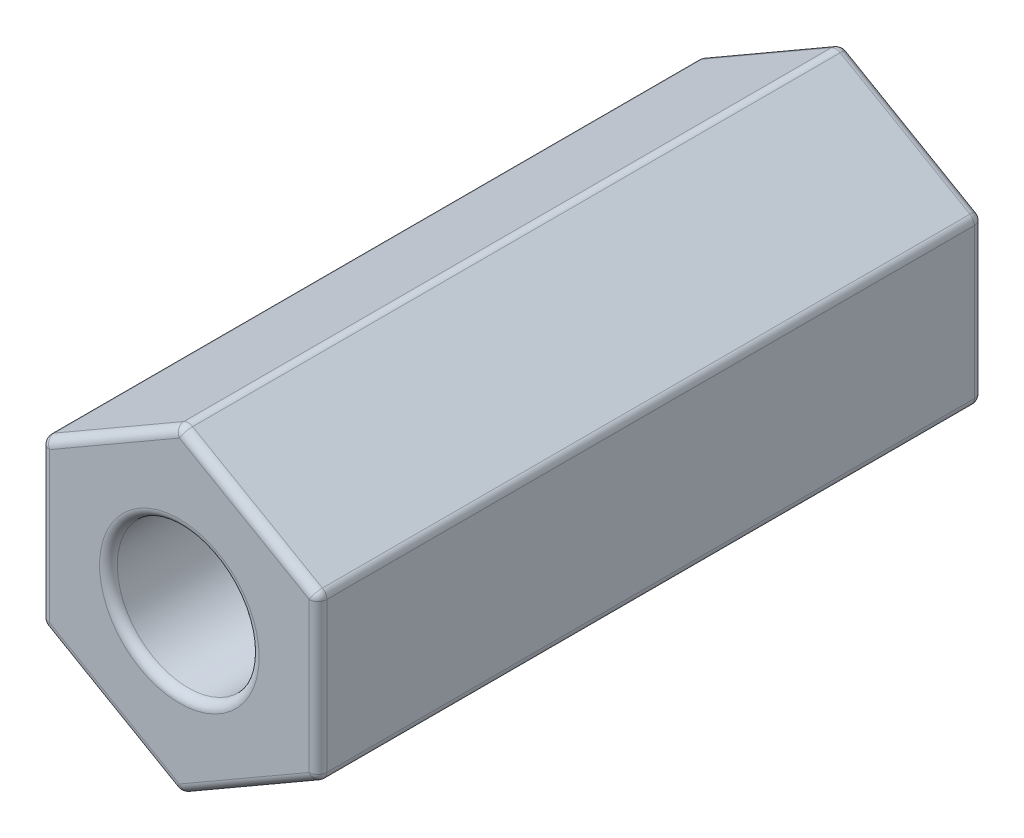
ISO-10303-21;
HEADER;
FILE_DESCRIPTION(('STEP AP214'),'2;1');
FILE_NAME('part.step','',(''),(''),'','','');
FILE_SCHEMA(('AUTOMOTIVE_DESIGN { 1 0 10303 214 1 1 1 1 }'));
ENDSEC;
DATA;
#1=APPLICATION_CONTEXT('core data for automotive mechanical design processes');
#2=APPLICATION_PROTOCOL_DEFINITION('international standard','automotive_design',2000,#1);
#3=PRODUCT_CONTEXT('',#1,'mechanical');
#4=PRODUCT('Part','Part','',(#3));
#5=PRODUCT_RELATED_PRODUCT_CATEGORY('part','',(#4));
#6=PRODUCT_DEFINITION_FORMATION('','',#4);
#7=PRODUCT_DEFINITION_CONTEXT('part definition',#1,'design');
#8=PRODUCT_DEFINITION('design','',#6,#7);
#9=PRODUCT_DEFINITION_SHAPE('','',#8);
#10=(LENGTH_UNIT() NAMED_UNIT(*) SI_UNIT(.MILLI.,.METRE.));
#11=(NAMED_UNIT(*) PLANE_ANGLE_UNIT() SI_UNIT($,.RADIAN.));
#12=(NAMED_UNIT(*) SI_UNIT($,.STERADIAN.) SOLID_ANGLE_UNIT());
#13=UNCERTAINTY_MEASURE_WITH_UNIT(LENGTH_MEASURE(1.E-05),#10,'distance_accuracy_value','');
#14=(GEOMETRIC_REPRESENTATION_CONTEXT(3) GLOBAL_UNCERTAINTY_ASSIGNED_CONTEXT((#13)) GLOBAL_UNIT_ASSIGNED_CONTEXT((#10,
#11,#12)) REPRESENTATION_CONTEXT('',''));
#15=CARTESIAN_POINT('',(0.,0.,0.));
#16=DIRECTION('',(0.,0.,1.));
#17=DIRECTION('',(1.,0.,0.));
#18=AXIS2_PLACEMENT_3D('',#15,#16,#17);
#19=CARTESIAN_POINT('',(3.96874999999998,2.29135888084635,-19.05));
#20=DIRECTION('',(0.499999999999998,0.86602540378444,0.));
#21=DIRECTION('',(-0.86602540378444,0.499999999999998,0.));
#22=AXIS2_PLACEMENT_3D('',#19,#20,#21);
#23=PLANE('',#22);
#24=DIRECTION('',(-0.86602540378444,0.499999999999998,0.));
#25=VECTOR('',#24,1.);
#26=CARTESIAN_POINT('',(3.96874999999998,2.29135888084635,-0.254000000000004));
#27=LINE('',#26,#25);
#28=CARTESIAN_POINT('',(0.127000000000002,4.50939427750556,-0.254000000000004));
#29=VERTEX_POINT('',#28);
#30=CARTESIAN_POINT('',(3.84174999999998,2.36468236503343,-0.254000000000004));
#31=VERTEX_POINT('',#30);
#32=EDGE_CURVE('E187',#29,#31,#27,.F.);
#33=ORIENTED_EDGE('',*,*,#32,.T.);
#34=DIRECTION('',(0.,0.,1.));
#35=VECTOR('',#34,1.);
#36=CARTESIAN_POINT('',(3.84174999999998,2.36468236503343,-19.05));
#37=LINE('',#36,#35);
#38=CARTESIAN_POINT('',(3.84174999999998,2.36468236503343,-18.796));
#39=VERTEX_POINT('',#38);
#40=EDGE_CURVE('E191',#31,#39,#37,.F.);
#41=ORIENTED_EDGE('',*,*,#40,.T.);
#42=DIRECTION('',(-0.86602540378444,0.499999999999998,0.));
#43=VECTOR('',#42,1.);
#44=CARTESIAN_POINT('',(0.,4.58271776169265,-18.796));
#45=LINE('',#44,#43);
#46=CARTESIAN_POINT('',(0.127000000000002,4.50939427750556,-18.796));
#47=VERTEX_POINT('',#46);
#48=EDGE_CURVE('E163',#39,#47,#45,.T.);
#49=ORIENTED_EDGE('',*,*,#48,.T.);
#50=DIRECTION('',(0.,0.,1.));
#51=VECTOR('',#50,1.);
#52=CARTESIAN_POINT('',(0.127000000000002,4.50939427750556,-19.05));
#53=LINE('',#52,#51);
#54=EDGE_CURVE('E181',#47,#29,#53,.T.);
#55=ORIENTED_EDGE('',*,*,#54,.T.);
#56=EDGE_LOOP('',(#33,#41,#49,#55));
#57=FACE_BOUND('',#56,.T.);
#58=ADVANCED_FACE('F36',(#57),#23,.T.);
#59=CARTESIAN_POINT('',(3.96875000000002,-2.29135888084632,-19.05));
#60=DIRECTION('',(1.,0.,0.));
#61=DIRECTION('',(0.,1.,0.));
#62=AXIS2_PLACEMENT_3D('',#59,#60,#61);
#63=PLANE('',#62);
#64=DIRECTION('',(0.,1.,0.));
#65=VECTOR('',#64,1.);
#66=CARTESIAN_POINT('',(3.96875000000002,-2.29135888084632,-0.254000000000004));
#67=LINE('',#66,#65);
#68=CARTESIAN_POINT('',(3.96874999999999,2.14471191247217,-0.254000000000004));
#69=VERTEX_POINT('',#68);
#70=CARTESIAN_POINT('',(3.96875000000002,-2.14471191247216,-0.254000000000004));
#71=VERTEX_POINT('',#70);
#72=EDGE_CURVE('E250',#69,#71,#67,.F.);
#73=ORIENTED_EDGE('',*,*,#72,.T.);
#74=DIRECTION('',(0.,0.,1.));
#75=VECTOR('',#74,1.);
#76=CARTESIAN_POINT('',(3.96875000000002,-2.14471191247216,-19.05));
#77=LINE('',#76,#75);
#78=CARTESIAN_POINT('',(3.96875000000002,-2.14471191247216,-18.796));
#79=VERTEX_POINT('',#78);
#80=EDGE_CURVE('E255',#71,#79,#77,.F.);
#81=ORIENTED_EDGE('',*,*,#80,.T.);
#82=DIRECTION('',(0.,1.,0.));
#83=VECTOR('',#82,1.);
#84=CARTESIAN_POINT('',(3.96874999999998,2.29135888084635,-18.796));
#85=LINE('',#84,#83);
#86=CARTESIAN_POINT('',(3.96874999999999,2.14471191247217,-18.796));
#87=VERTEX_POINT('',#86);
#88=EDGE_CURVE('E252',#79,#87,#85,.T.);
#89=ORIENTED_EDGE('',*,*,#88,.T.);
#90=DIRECTION('',(0.,0.,1.));
#91=VECTOR('',#90,1.);
#92=CARTESIAN_POINT('',(3.96874999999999,2.14471191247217,-19.05));
#93=LINE('',#92,#91);
#94=EDGE_CURVE('E248',#87,#69,#93,.T.);
#95=ORIENTED_EDGE('',*,*,#94,.T.);
#96=EDGE_LOOP('',(#73,#81,#89,#95));
#97=FACE_BOUND('',#96,.T.);
#98=ADVANCED_FACE('F420',(#97),#63,.T.);
#99=CARTESIAN_POINT('',(0.,-4.58271776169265,-19.05));
#100=DIRECTION('',(0.499999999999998,-0.86602540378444,0.));
#101=DIRECTION('',(0.86602540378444,0.499999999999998,0.));
#102=AXIS2_PLACEMENT_3D('',#99,#100,#101);
#103=PLANE('',#102);
#104=DIRECTION('',(0.86602540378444,0.499999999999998,0.));
#105=VECTOR('',#104,1.);
#106=CARTESIAN_POINT('',(0.,-4.58271776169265,-0.254000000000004));
#107=LINE('',#106,#105);
#108=CARTESIAN_POINT('',(3.84175000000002,-2.36468236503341,-0.254000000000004));
#109=VERTEX_POINT('',#108);
#110=CARTESIAN_POINT('',(0.127000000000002,-4.50939427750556,-0.254000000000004));
#111=VERTEX_POINT('',#110);
#112=EDGE_CURVE('E241',#109,#111,#107,.F.);
#113=ORIENTED_EDGE('',*,*,#112,.T.);
#114=DIRECTION('',(0.,0.,1.));
#115=VECTOR('',#114,1.);
#116=CARTESIAN_POINT('',(0.127000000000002,-4.50939427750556,-19.05));
#117=LINE('',#116,#115);
#118=CARTESIAN_POINT('',(0.127000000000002,-4.50939427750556,-18.796));
#119=VERTEX_POINT('',#118);
#120=EDGE_CURVE('E246',#111,#119,#117,.F.);
#121=ORIENTED_EDGE('',*,*,#120,.T.);
#122=DIRECTION('',(0.86602540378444,0.499999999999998,0.));
#123=VECTOR('',#122,1.);
#124=CARTESIAN_POINT('',(3.96875000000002,-2.29135888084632,-18.796));
#125=LINE('',#124,#123);
#126=CARTESIAN_POINT('',(3.84175000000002,-2.36468236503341,-18.796));
#127=VERTEX_POINT('',#126);
#128=EDGE_CURVE('E243',#119,#127,#125,.T.);
#129=ORIENTED_EDGE('',*,*,#128,.T.);
#130=DIRECTION('',(0.,0.,1.));
#131=VECTOR('',#130,1.);
#132=CARTESIAN_POINT('',(3.84175000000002,-2.36468236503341,-19.05));
#133=LINE('',#132,#131);
#134=EDGE_CURVE('E239',#127,#109,#133,.T.);
#135=ORIENTED_EDGE('',*,*,#134,.T.);
#136=EDGE_LOOP('',(#113,#121,#129,#135));
#137=FACE_BOUND('',#136,.T.);
#138=ADVANCED_FACE('F324',(#137),#103,.T.);
#139=CARTESIAN_POINT('',(-3.96874999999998,-2.29135888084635,-19.05));
#140=DIRECTION('',(-0.499999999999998,-0.86602540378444,0.));
#141=DIRECTION('',(0.86602540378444,-0.499999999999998,0.));
#142=AXIS2_PLACEMENT_3D('',#139,#140,#141);
#143=PLANE('',#142);
#144=DIRECTION('',(0.86602540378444,-0.499999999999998,0.));
#145=VECTOR('',#144,1.);
#146=CARTESIAN_POINT('',(-3.96874999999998,-2.29135888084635,-0.254000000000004));
#147=LINE('',#146,#145);
#148=CARTESIAN_POINT('',(-0.127000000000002,-4.50939427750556,-0.254000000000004));
#149=VERTEX_POINT('',#148);
#150=CARTESIAN_POINT('',(-3.84174999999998,-2.36468236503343,-0.254000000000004));
#151=VERTEX_POINT('',#150);
#152=EDGE_CURVE('E232',#149,#151,#147,.F.);
#153=ORIENTED_EDGE('',*,*,#152,.T.);
#154=DIRECTION('',(0.,0.,1.));
#155=VECTOR('',#154,1.);
#156=CARTESIAN_POINT('',(-3.84174999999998,-2.36468236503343,-19.05));
#157=LINE('',#156,#155);
#158=CARTESIAN_POINT('',(-3.84174999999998,-2.36468236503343,-18.796));
#159=VERTEX_POINT('',#158);
#160=EDGE_CURVE('E237',#151,#159,#157,.F.);
#161=ORIENTED_EDGE('',*,*,#160,.T.);
#162=DIRECTION('',(0.86602540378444,-0.499999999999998,0.));
#163=VECTOR('',#162,1.);
#164=CARTESIAN_POINT('',(0.,-4.58271776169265,-18.796));
#165=LINE('',#164,#163);
#166=CARTESIAN_POINT('',(-0.127000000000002,-4.50939427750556,-18.796));
#167=VERTEX_POINT('',#166);
#168=EDGE_CURVE('E234',#159,#167,#165,.T.);
#169=ORIENTED_EDGE('',*,*,#168,.T.);
#170=DIRECTION('',(0.,0.,1.));
#171=VECTOR('',#170,1.);
#172=CARTESIAN_POINT('',(-0.127000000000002,-4.50939427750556,-19.05));
#173=LINE('',#172,#171);
#174=EDGE_CURVE('E230',#167,#149,#173,.T.);
#175=ORIENTED_EDGE('',*,*,#174,.T.);
#176=EDGE_LOOP('',(#153,#161,#169,#175));
#177=FACE_BOUND('',#176,.T.);
#178=ADVANCED_FACE('F502',(#177),#143,.T.);
#179=CARTESIAN_POINT('',(-3.96875000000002,2.29135888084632,-19.05));
#180=DIRECTION('',(-1.,0.,0.));
#181=DIRECTION('',(0.,-1.,0.));
#182=AXIS2_PLACEMENT_3D('',#179,#180,#181);
#183=PLANE('',#182);
#184=DIRECTION('',(0.,-1.,0.));
#185=VECTOR('',#184,1.);
#186=CARTESIAN_POINT('',(-3.96874999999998,-2.29135888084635,-18.796));
#187=LINE('',#186,#185);
#188=CARTESIAN_POINT('',(-3.96875000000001,2.14471191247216,-18.796));
#189=VERTEX_POINT('',#188);
#190=CARTESIAN_POINT('',(-3.96874999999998,-2.14471191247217,-18.796));
#191=VERTEX_POINT('',#190);
#192=EDGE_CURVE('E225',#189,#191,#187,.T.);
#193=ORIENTED_EDGE('',*,*,#192,.T.);
#194=DIRECTION('',(0.,0.,1.));
#195=VECTOR('',#194,1.);
#196=CARTESIAN_POINT('',(-3.96874999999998,-2.14471191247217,-19.05));
#197=LINE('',#196,#195);
#198=CARTESIAN_POINT('',(-3.96874999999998,-2.14471191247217,-0.254000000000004));
#199=VERTEX_POINT('',#198);
#200=EDGE_CURVE('E228',#191,#199,#197,.T.);
#201=ORIENTED_EDGE('',*,*,#200,.T.);
#202=DIRECTION('',(0.,-1.,0.));
#203=VECTOR('',#202,1.);
#204=CARTESIAN_POINT('',(-3.96875000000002,2.29135888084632,-0.254000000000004));
#205=LINE('',#204,#203);
#206=CARTESIAN_POINT('',(-3.96875000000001,2.14471191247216,-0.254000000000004));
#207=VERTEX_POINT('',#206);
#208=EDGE_CURVE('E223',#199,#207,#205,.F.);
#209=ORIENTED_EDGE('',*,*,#208,.T.);
#210=DIRECTION('',(0.,0.,1.));
#211=VECTOR('',#210,1.);
#212=CARTESIAN_POINT('',(-3.96875000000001,2.14471191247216,-19.05));
#213=LINE('',#212,#211);
#214=EDGE_CURVE('E221',#207,#189,#213,.F.);
#215=ORIENTED_EDGE('',*,*,#214,.T.);
#216=EDGE_LOOP('',(#193,#201,#209,#215));
#217=FACE_BOUND('',#216,.T.);
#218=ADVANCED_FACE('F483',(#217),#183,.T.);
#219=CARTESIAN_POINT('',(0.,4.58271776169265,-19.05));
#220=DIRECTION('',(-0.499999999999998,0.86602540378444,0.));
#221=DIRECTION('',(-0.86602540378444,-0.499999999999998,0.));
#222=AXIS2_PLACEMENT_3D('',#219,#220,#221);
#223=PLANE('',#222);
#224=DIRECTION('',(-0.86602540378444,-0.499999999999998,0.));
#225=VECTOR('',#224,1.);
#226=CARTESIAN_POINT('',(-3.96875000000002,2.29135888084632,-18.796));
#227=LINE('',#226,#225);
#228=CARTESIAN_POINT('',(-0.127000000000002,4.50939427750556,-18.796));
#229=VERTEX_POINT('',#228);
#230=CARTESIAN_POINT('',(-3.84175000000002,2.36468236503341,-18.796));
#231=VERTEX_POINT('',#230);
#232=EDGE_CURVE('E216',#229,#231,#227,.T.);
#233=ORIENTED_EDGE('',*,*,#232,.T.);
#234=DIRECTION('',(0.,0.,1.));
#235=VECTOR('',#234,1.);
#236=CARTESIAN_POINT('',(-3.84175000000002,2.36468236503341,-19.05));
#237=LINE('',#236,#235);
#238=CARTESIAN_POINT('',(-3.84175000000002,2.36468236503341,-0.254000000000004));
#239=VERTEX_POINT('',#238);
#240=EDGE_CURVE('E219',#231,#239,#237,.T.);
#241=ORIENTED_EDGE('',*,*,#240,.T.);
#242=DIRECTION('',(-0.86602540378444,-0.499999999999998,0.));
#243=VECTOR('',#242,1.);
#244=CARTESIAN_POINT('',(0.,4.58271776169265,-0.254000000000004));
#245=LINE('',#244,#243);
#246=CARTESIAN_POINT('',(-0.127000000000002,4.50939427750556,-0.254000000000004));
#247=VERTEX_POINT('',#246);
#248=EDGE_CURVE('E214',#239,#247,#245,.F.);
#249=ORIENTED_EDGE('',*,*,#248,.T.);
#250=DIRECTION('',(0.,0.,1.));
#251=VECTOR('',#250,1.);
#252=CARTESIAN_POINT('',(-0.127000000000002,4.50939427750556,-19.05));
#253=LINE('',#252,#251);
#254=EDGE_CURVE('E212',#247,#229,#253,.F.);
#255=ORIENTED_EDGE('',*,*,#254,.T.);
#256=EDGE_LOOP('',(#233,#241,#249,#255));
#257=FACE_BOUND('',#256,.T.);
#258=ADVANCED_FACE('F456',(#257),#223,.T.);
#259=CARTESIAN_POINT('',(0.,4.58271776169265,-19.05));
#260=DIRECTION('',(0.,0.,1.));
#261=DIRECTION('',(1.,0.,0.));
#262=AXIS2_PLACEMENT_3D('',#259,#260,#261);
#263=PLANE('',#262);
#264=DIRECTION('',(-0.86602540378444,-0.499999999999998,0.));
#265=VECTOR('',#264,1.);
#266=CARTESIAN_POINT('',(0.127000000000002,4.3627473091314,-19.05));
#267=LINE('',#266,#265);
#268=CARTESIAN_POINT('',(-3.71475000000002,2.14471191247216,-19.05));
#269=VERTEX_POINT('',#268);
#270=CARTESIAN_POINT('',(0.,4.28942382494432,-19.05));
#271=VERTEX_POINT('',#270);
#272=EDGE_CURVE('E209',#269,#271,#267,.F.);
#273=ORIENTED_EDGE('',*,*,#272,.T.);
#274=DIRECTION('',(-0.86602540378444,0.499999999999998,0.));
#275=VECTOR('',#274,1.);
#276=CARTESIAN_POINT('',(3.84174999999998,2.0713884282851,-19.05));
#277=LINE('',#276,#275);
#278=CARTESIAN_POINT('',(3.71474999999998,2.14471191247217,-19.05));
#279=VERTEX_POINT('',#278);
#280=EDGE_CURVE('E165',#271,#279,#277,.F.);
#281=ORIENTED_EDGE('',*,*,#280,.T.);
#282=DIRECTION('',(0.,1.,0.));
#283=VECTOR('',#282,1.);
#284=CARTESIAN_POINT('',(3.71475000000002,-2.29135888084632,-19.05));
#285=LINE('',#284,#283);
#286=CARTESIAN_POINT('',(3.71475000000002,-2.14471191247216,-19.05));
#287=VERTEX_POINT('',#286);
#288=EDGE_CURVE('E201',#279,#287,#285,.F.);
#289=ORIENTED_EDGE('',*,*,#288,.T.);
#290=DIRECTION('',(0.86602540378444,0.499999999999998,0.));
#291=VECTOR('',#290,1.);
#292=CARTESIAN_POINT('',(-0.127000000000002,-4.3627473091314,-19.05));
#293=LINE('',#292,#291);
#294=CARTESIAN_POINT('',(0.,-4.28942382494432,-19.05));
#295=VERTEX_POINT('',#294);
#296=EDGE_CURVE('E203',#287,#295,#293,.F.);
#297=ORIENTED_EDGE('',*,*,#296,.T.);
#298=DIRECTION('',(0.86602540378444,-0.499999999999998,0.));
#299=VECTOR('',#298,1.);
#300=CARTESIAN_POINT('',(-3.84174999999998,-2.0713884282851,-19.05));
#301=LINE('',#300,#299);
#302=CARTESIAN_POINT('',(-3.71474999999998,-2.14471191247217,-19.05));
#303=VERTEX_POINT('',#302);
#304=EDGE_CURVE('E205',#295,#303,#301,.F.);
#305=ORIENTED_EDGE('',*,*,#304,.T.);
#306=DIRECTION('',(0.,-1.,0.));
#307=VECTOR('',#306,1.);
#308=CARTESIAN_POINT('',(-3.71475000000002,2.29135888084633,-19.05));
#309=LINE('',#308,#307);
#310=EDGE_CURVE('E207',#303,#269,#309,.F.);
#311=ORIENTED_EDGE('',*,*,#310,.T.);
#312=EDGE_LOOP('',(#273,#281,#289,#297,#305,#311));
#313=FACE_BOUND('',#312,.T.);
#314=CARTESIAN_POINT('',(0.,0.,-19.05));
#315=DIRECTION('',(0.,0.,1.));
#316=DIRECTION('',(1.,0.,0.));
#317=AXIS2_PLACEMENT_3D('',#314,#315,#316);
#318=CIRCLE('',#317,2.286);
#319=CARTESIAN_POINT('',(2.286,0.,-19.05));
#320=VERTEX_POINT('',#319);
#321=EDGE_CURVE('E194',#320,#320,#318,.T.);
#322=ORIENTED_EDGE('',*,*,#321,.T.);
#323=EDGE_LOOP('',(#322));
#324=FACE_BOUND('',#323,.T.);
#325=ADVANCED_FACE('F473',(#313,#324),#263,.F.);
#326=CARTESIAN_POINT('',(0.,4.58271776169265,0.));
#327=DIRECTION('',(0.,0.,1.));
#328=DIRECTION('',(1.,0.,0.));
#329=AXIS2_PLACEMENT_3D('',#326,#327,#328);
#330=PLANE('',#329);
#331=DIRECTION('',(0.86602540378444,0.499999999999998,0.));
#332=VECTOR('',#331,1.);
#333=CARTESIAN_POINT('',(3.84174999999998,-2.0713884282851,0.));
#334=LINE('',#333,#332);
#335=CARTESIAN_POINT('',(0.,-4.28942382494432,0.));
#336=VERTEX_POINT('',#335);
#337=CARTESIAN_POINT('',(3.71475000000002,-2.14471191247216,0.));
#338=VERTEX_POINT('',#337);
#339=EDGE_CURVE('E43',#336,#338,#334,.T.);
#340=ORIENTED_EDGE('',*,*,#339,.T.);
#341=DIRECTION('',(0.,1.,0.));
#342=VECTOR('',#341,1.);
#343=CARTESIAN_POINT('',(3.71474999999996,4.58271776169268,0.));
#344=LINE('',#343,#342);
#345=CARTESIAN_POINT('',(3.71474999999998,2.14471191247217,0.));
#346=VERTEX_POINT('',#345);
#347=EDGE_CURVE('E11',#338,#346,#344,.T.);
#348=ORIENTED_EDGE('',*,*,#347,.T.);
#349=DIRECTION('',(-0.86602540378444,0.499999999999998,0.));
#350=VECTOR('',#349,1.);
#351=CARTESIAN_POINT('',(-0.127000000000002,4.3627473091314,0.));
#352=LINE('',#351,#350);
#353=CARTESIAN_POINT('',(0.,4.28942382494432,0.));
#354=VERTEX_POINT('',#353);
#355=EDGE_CURVE('E269',#346,#354,#352,.T.);
#356=ORIENTED_EDGE('',*,*,#355,.T.);
#357=DIRECTION('',(-0.86602540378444,-0.499999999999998,0.));
#358=VECTOR('',#357,1.);
#359=CARTESIAN_POINT('',(0.127000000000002,4.3627473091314,0.));
#360=LINE('',#359,#358);
#361=CARTESIAN_POINT('',(-3.71475000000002,2.14471191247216,0.));
#362=VERTEX_POINT('',#361);
#363=EDGE_CURVE('E271',#354,#362,#360,.T.);
#364=ORIENTED_EDGE('',*,*,#363,.T.);
#365=DIRECTION('',(0.,-1.,0.));
#366=VECTOR('',#365,1.);
#367=CARTESIAN_POINT('',(-3.71475000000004,4.58271776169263,0.));
#368=LINE('',#367,#366);
#369=CARTESIAN_POINT('',(-3.71474999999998,-2.14471191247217,0.));
#370=VERTEX_POINT('',#369);
#371=EDGE_CURVE('E273',#362,#370,#368,.T.);
#372=ORIENTED_EDGE('',*,*,#371,.T.);
#373=DIRECTION('',(0.86602540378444,-0.499999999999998,0.));
#374=VECTOR('',#373,1.);
#375=CARTESIAN_POINT('',(-3.84174999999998,-2.0713884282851,0.));
#376=LINE('',#375,#374);
#377=EDGE_CURVE('E53',#370,#336,#376,.T.);
#378=ORIENTED_EDGE('',*,*,#377,.T.);
#379=EDGE_LOOP('',(#340,#348,#356,#364,#372,#378));
#380=FACE_BOUND('',#379,.T.);
#381=CARTESIAN_POINT('',(0.,0.,0.));
#382=DIRECTION('',(0.,0.,1.));
#383=DIRECTION('',(1.,0.,0.));
#384=AXIS2_PLACEMENT_3D('',#381,#382,#383);
#385=CIRCLE('',#384,2.286);
#386=CARTESIAN_POINT('',(2.286,0.,0.));
#387=VERTEX_POINT('',#386);
#388=EDGE_CURVE('E265',#387,#387,#385,.F.);
#389=ORIENTED_EDGE('',*,*,#388,.T.);
#390=EDGE_LOOP('',(#389));
#391=FACE_BOUND('',#390,.T.);
#392=ADVANCED_FACE('F276',(#380,#391),#330,.T.);
#393=CARTESIAN_POINT('',(0.,0.,-19.05));
#394=DIRECTION('',(0.,0.,1.));
#395=DIRECTION('',(1.,0.,0.));
#396=AXIS2_PLACEMENT_3D('',#393,#394,#395);
#397=CYLINDRICAL_SURFACE('',#396,2.032);
#398=CARTESIAN_POINT('',(0.,0.,-18.796));
#399=DIRECTION('',(0.,0.,1.));
#400=DIRECTION('',(1.,0.,0.));
#401=AXIS2_PLACEMENT_3D('',#398,#399,#400);
#402=CIRCLE('',#401,2.032);
#403=CARTESIAN_POINT('',(2.032,0.,-18.796));
#404=VERTEX_POINT('',#403);
#405=EDGE_CURVE('E261',#404,#404,#402,.F.);
#406=CARTESIAN_POINT('',(0.,0.,-0.254000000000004));
#407=DIRECTION('',(0.,0.,1.));
#408=DIRECTION('',(1.,0.,0.));
#409=AXIS2_PLACEMENT_3D('',#406,#407,#408);
#410=CIRCLE('',#409,2.032);
#411=CARTESIAN_POINT('',(2.032,0.,-0.254000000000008));
#412=VERTEX_POINT('',#411);
#413=EDGE_CURVE('E257',#412,#412,#410,.T.);
#414=CARTESIAN_POINT('',(2.032,0.,-18.796));
#415=CARTESIAN_POINT('',(2.032,0.,-18.6028541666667));
#416=CARTESIAN_POINT('',(2.032,0.,-18.4097083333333));
#417=CARTESIAN_POINT('',(2.032,0.,-18.0234166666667));
#418=CARTESIAN_POINT('',(2.032,0.,-17.8302708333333));
#419=CARTESIAN_POINT('',(2.032,0.,-17.4439791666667));
#420=CARTESIAN_POINT('',(2.032,0.,-17.2508333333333));
#421=CARTESIAN_POINT('',(2.032,0.,-16.8645416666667));
#422=CARTESIAN_POINT('',(2.032,0.,-16.6713958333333));
#423=CARTESIAN_POINT('',(2.032,0.,-16.2851041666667));
#424=CARTESIAN_POINT('',(2.032,0.,-16.0919583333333));
#425=CARTESIAN_POINT('',(2.032,0.,-15.7056666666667));
#426=CARTESIAN_POINT('',(2.032,0.,-15.5125208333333));
#427=CARTESIAN_POINT('',(2.032,0.,-15.1262291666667));
#428=CARTESIAN_POINT('',(2.032,0.,-14.9330833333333));
#429=CARTESIAN_POINT('',(2.032,0.,-14.5467916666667));
#430=CARTESIAN_POINT('',(2.032,0.,-14.3536458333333));
#431=CARTESIAN_POINT('',(2.032,0.,-13.9673541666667));
#432=CARTESIAN_POINT('',(2.032,0.,-13.7742083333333));
#433=CARTESIAN_POINT('',(2.032,0.,-13.3879166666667));
#434=CARTESIAN_POINT('',(2.032,0.,-13.1947708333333));
#435=CARTESIAN_POINT('',(2.032,0.,-12.8084791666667));
#436=CARTESIAN_POINT('',(2.032,0.,-12.6153333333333));
#437=CARTESIAN_POINT('',(2.032,0.,-12.2290416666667));
#438=CARTESIAN_POINT('',(2.032,0.,-12.0358958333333));
#439=CARTESIAN_POINT('',(2.032,0.,-11.6496041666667));
#440=CARTESIAN_POINT('',(2.032,0.,-11.4564583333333));
#441=CARTESIAN_POINT('',(2.032,0.,-11.0701666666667));
#442=CARTESIAN_POINT('',(2.032,0.,-10.8770208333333));
#443=CARTESIAN_POINT('',(2.032,0.,-10.4907291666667));
#444=CARTESIAN_POINT('',(2.032,0.,-10.2975833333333));
#445=CARTESIAN_POINT('',(2.032,0.,-9.91129166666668));
#446=CARTESIAN_POINT('',(2.032,0.,-9.71814583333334));
#447=CARTESIAN_POINT('',(2.032,0.,-9.33185416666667));
#448=CARTESIAN_POINT('',(2.032,0.,-9.13870833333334));
#449=CARTESIAN_POINT('',(2.032,0.,-8.75241666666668));
#450=CARTESIAN_POINT('',(2.032,0.,-8.55927083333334));
#451=CARTESIAN_POINT('',(2.032,0.,-8.17297916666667));
#452=CARTESIAN_POINT('',(2.032,0.,-7.97983333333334));
#453=CARTESIAN_POINT('',(2.032,0.,-7.59354166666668));
#454=CARTESIAN_POINT('',(2.032,0.,-7.40039583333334));
#455=CARTESIAN_POINT('',(2.032,0.,-7.01410416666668));
#456=CARTESIAN_POINT('',(2.032,0.,-6.82095833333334));
#457=CARTESIAN_POINT('',(2.032,0.,-6.43466666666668));
#458=CARTESIAN_POINT('',(2.032,0.,-6.24152083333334));
#459=CARTESIAN_POINT('',(2.032,0.,-5.85522916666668));
#460=CARTESIAN_POINT('',(2.032,0.,-5.66208333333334));
#461=CARTESIAN_POINT('',(2.032,0.,-5.27579166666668));
#462=CARTESIAN_POINT('',(2.032,0.,-5.08264583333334));
#463=CARTESIAN_POINT('',(2.032,0.,-4.69635416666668));
#464=CARTESIAN_POINT('',(2.032,0.,-4.50320833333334));
#465=CARTESIAN_POINT('',(2.032,0.,-4.11691666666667));
#466=CARTESIAN_POINT('',(2.032,0.,-3.92377083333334));
#467=CARTESIAN_POINT('',(2.032,0.,-3.53747916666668));
#468=CARTESIAN_POINT('',(2.032,0.,-3.34433333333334));
#469=CARTESIAN_POINT('',(2.032,0.,-2.95804166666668));
#470=CARTESIAN_POINT('',(2.032,0.,-2.76489583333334));
#471=CARTESIAN_POINT('',(2.032,0.,-2.37860416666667));
#472=CARTESIAN_POINT('',(2.032,0.,-2.18545833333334));
#473=CARTESIAN_POINT('',(2.032,0.,-1.79916666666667));
#474=CARTESIAN_POINT('',(2.032,0.,-1.60602083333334));
#475=CARTESIAN_POINT('',(2.032,0.,-1.21972916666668));
#476=CARTESIAN_POINT('',(2.032,0.,-1.02658333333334));
#477=CARTESIAN_POINT('',(2.032,0.,-0.640291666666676));
#478=CARTESIAN_POINT('',(2.032,0.,-0.447145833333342));
#479=CARTESIAN_POINT('',(2.032,0.,-0.254000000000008));
#480=B_SPLINE_CURVE_WITH_KNOTS('',3,(#414,#415,#416,#417,#418,#419,#420,#421,#422,#423,#424,
#425,#426,#427,#428,#429,#430,#431,#432,#433,#434,#435,#436,#437,#438,#439,#440,#441,#442,#443,
#444,#445,#446,#447,#448,#449,#450,#451,#452,#453,#454,#455,#456,#457,#458,#459,#460,#461,#462,
#463,#464,#465,#466,#467,#468,#469,#470,#471,#472,#473,#474,#475,#476,#477,#478,#479),
.UNSPECIFIED.,.F.,.F.,(4,2,2,2,2,2,2,2,2,2,2,2,2,2,2,2,2,2,2,2,2,2,2,2,2,2,2,2,2,2,2,2,4),(0.,
0.579437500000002,1.158875,1.7383125,2.31775,2.8971875,3.476625,4.0560625,4.6355,5.2149375,
5.794375,6.3738125,6.95325,7.5326875,8.112125,8.6915625,9.271,9.8504375,10.429875,11.0093125,
11.58875,12.1681875,12.747625,13.3270625,13.9065,14.4859375,15.065375,15.6448125,16.22425,
16.8036875,17.383125,17.9625625,18.542),.UNSPECIFIED.);
#481=EDGE_CURVE('BSEAM518',#404,#412,#480,.T.);
#482=ORIENTED_EDGE('',*,*,#405,.T.);
#483=ORIENTED_EDGE('',*,*,#413,.T.);
#484=ORIENTED_EDGE('',*,*,#481,.T.);
#485=ORIENTED_EDGE('',*,*,#481,.F.);
#486=EDGE_LOOP('',(#482,#484,#483,#485));
#487=FACE_BOUND('',#486,.T.);
#488=ADVANCED_FACE('F518',(#487),#397,.F.);
#489=CARTESIAN_POINT('',(-3.84174999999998,-2.0713884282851,-0.254000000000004));
#490=DIRECTION('',(0.86602540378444,-0.499999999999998,0.));
#491=DIRECTION('',(0.499999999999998,0.86602540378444,0.));
#492=AXIS2_PLACEMENT_3D('',#489,#490,#491);
#493=CYLINDRICAL_SURFACE('',#492,0.254);
#494=CARTESIAN_POINT('',(0.,-4.28942382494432,-0.254000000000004));
#495=DIRECTION('',(0.866025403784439,-0.5,0.));
#496=DIRECTION('',(0.5,0.866025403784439,0.));
#497=AXIS2_PLACEMENT_3D('',#494,#495,#496);
#498=CIRCLE('',#497,0.254);
#499=EDGE_CURVE('E188',#336,#149,#498,.T.);
#500=ORIENTED_EDGE('',*,*,#499,.F.);
#501=ORIENTED_EDGE('',*,*,#377,.F.);
#502=CARTESIAN_POINT('',(-3.71474999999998,-2.14471191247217,-0.254000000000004));
#503=DIRECTION('',(-0.86602540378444,0.499999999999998,0.));
#504=DIRECTION('',(-0.499999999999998,-0.86602540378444,0.));
#505=AXIS2_PLACEMENT_3D('',#502,#503,#504);
#506=CIRCLE('',#505,0.254);
#507=EDGE_CURVE('E288',#151,#370,#506,.T.);
#508=ORIENTED_EDGE('',*,*,#507,.F.);
#509=ORIENTED_EDGE('',*,*,#152,.F.);
#510=EDGE_LOOP('',(#500,#501,#508,#509));
#511=FACE_BOUND('',#510,.T.);
#512=ADVANCED_FACE('F286',(#511),#493,.T.);
#513=CARTESIAN_POINT('',(0.,-4.28942382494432,-0.254000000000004));
#514=DIRECTION('',(0.,0.,1.));
#515=DIRECTION('',(1.,0.,0.));
#516=AXIS2_PLACEMENT_3D('',#513,#514,#515);
#517=SPHERICAL_SURFACE('',#516,0.254);
#518=CARTESIAN_POINT('',(0.,-4.28942382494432,-0.254000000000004));
#519=DIRECTION('',(-0.86602540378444,-0.499999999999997,0.));
#520=DIRECTION('',(0.499999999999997,-0.86602540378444,0.));
#521=AXIS2_PLACEMENT_3D('',#518,#519,#520);
#522=CIRCLE('',#521,0.254);
#523=EDGE_CURVE('E303',#336,#111,#522,.F.);
#524=ORIENTED_EDGE('',*,*,#523,.F.);
#525=ORIENTED_EDGE('',*,*,#499,.T.);
#526=CARTESIAN_POINT('',(0.,-4.28942382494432,-0.254000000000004));
#527=DIRECTION('',(0.,0.,1.));
#528=DIRECTION('',(1.,0.,0.));
#529=AXIS2_PLACEMENT_3D('',#526,#527,#528);
#530=CIRCLE('',#529,0.254);
#531=EDGE_CURVE('E300',#111,#149,#530,.F.);
#532=ORIENTED_EDGE('',*,*,#531,.F.);
#533=EDGE_LOOP('',(#524,#525,#532));
#534=FACE_BOUND('',#533,.T.);
#535=ADVANCED_FACE('F315',(#534),#517,.T.);
#536=CARTESIAN_POINT('',(-3.71474999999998,-2.14471191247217,-0.254000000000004));
#537=DIRECTION('',(0.,0.,1.));
#538=DIRECTION('',(1.,0.,0.));
#539=AXIS2_PLACEMENT_3D('',#536,#537,#538);
#540=SPHERICAL_SURFACE('',#539,0.254);
#541=CARTESIAN_POINT('',(-3.71474999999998,-2.14471191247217,-0.254000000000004));
#542=DIRECTION('',(0.,0.,1.));
#543=DIRECTION('',(1.,0.,0.));
#544=AXIS2_PLACEMENT_3D('',#541,#542,#543);
#545=CIRCLE('',#544,0.254);
#546=EDGE_CURVE('E298',#151,#199,#545,.F.);
#547=ORIENTED_EDGE('',*,*,#546,.F.);
#548=ORIENTED_EDGE('',*,*,#507,.T.);
#549=CARTESIAN_POINT('',(-3.71474999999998,-2.14471191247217,-0.254000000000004));
#550=DIRECTION('',(0.,-1.,0.));
#551=DIRECTION('',(1.,0.,0.));
#552=AXIS2_PLACEMENT_3D('',#549,#550,#551);
#553=CIRCLE('',#552,0.254);
#554=EDGE_CURVE('E295',#199,#370,#553,.F.);
#555=ORIENTED_EDGE('',*,*,#554,.F.);
#556=EDGE_LOOP('',(#547,#548,#555));
#557=FACE_BOUND('',#556,.T.);
#558=ADVANCED_FACE('F294',(#557),#540,.T.);
#559=CARTESIAN_POINT('',(0.,-4.28942382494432,-19.05));
#560=DIRECTION('',(0.,0.,1.));
#561=DIRECTION('',(1.,0.,0.));
#562=AXIS2_PLACEMENT_3D('',#559,#560,#561);
#563=CYLINDRICAL_SURFACE('',#562,0.254);
#564=ORIENTED_EDGE('',*,*,#531,.T.);
#565=ORIENTED_EDGE('',*,*,#174,.F.);
#566=CARTESIAN_POINT('',(0.,-4.28942382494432,-18.796));
#567=DIRECTION('',(0.,0.,-1.));
#568=DIRECTION('',(-1.,0.,0.));
#569=AXIS2_PLACEMENT_3D('',#566,#567,#568);
#570=CIRCLE('',#569,0.254);
#571=EDGE_CURVE('E321',#119,#167,#570,.T.);
#572=ORIENTED_EDGE('',*,*,#571,.F.);
#573=ORIENTED_EDGE('',*,*,#120,.F.);
#574=EDGE_LOOP('',(#564,#565,#572,#573));
#575=FACE_BOUND('',#574,.T.);
#576=ADVANCED_FACE('F319',(#575),#563,.T.);
#577=CARTESIAN_POINT('',(3.84174999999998,-2.0713884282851,-0.254000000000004));
#578=DIRECTION('',(0.86602540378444,0.499999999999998,0.));
#579=DIRECTION('',(-0.499999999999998,0.86602540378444,0.));
#580=AXIS2_PLACEMENT_3D('',#577,#578,#579);
#581=CYLINDRICAL_SURFACE('',#580,0.254);
#582=ORIENTED_EDGE('',*,*,#523,.T.);
#583=ORIENTED_EDGE('',*,*,#112,.F.);
#584=CARTESIAN_POINT('',(3.71475000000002,-2.14471191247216,-0.254000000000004));
#585=DIRECTION('',(0.866025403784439,0.5,0.));
#586=DIRECTION('',(-0.5,0.866025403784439,0.));
#587=AXIS2_PLACEMENT_3D('',#584,#585,#586);
#588=CIRCLE('',#587,0.254);
#589=EDGE_CURVE('E331',#338,#109,#588,.T.);
#590=ORIENTED_EDGE('',*,*,#589,.F.);
#591=ORIENTED_EDGE('',*,*,#339,.F.);
#592=EDGE_LOOP('',(#582,#583,#590,#591));
#593=FACE_BOUND('',#592,.T.);
#594=ADVANCED_FACE('F330',(#593),#581,.T.);
#595=CARTESIAN_POINT('',(-3.71475000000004,4.58271776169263,-0.254000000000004));
#596=DIRECTION('',(0.,-1.,0.));
#597=DIRECTION('',(1.,0.,0.));
#598=AXIS2_PLACEMENT_3D('',#595,#596,#597);
#599=CYLINDRICAL_SURFACE('',#598,0.254);
#600=ORIENTED_EDGE('',*,*,#554,.T.);
#601=ORIENTED_EDGE('',*,*,#371,.F.);
#602=CARTESIAN_POINT('',(-3.71475000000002,2.14471191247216,-0.254000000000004));
#603=DIRECTION('',(0.,1.,0.));
#604=DIRECTION('',(-1.,0.,0.));
#605=AXIS2_PLACEMENT_3D('',#602,#603,#604);
#606=CIRCLE('',#605,0.254);
#607=EDGE_CURVE('E336',#207,#362,#606,.T.);
#608=ORIENTED_EDGE('',*,*,#607,.F.);
#609=ORIENTED_EDGE('',*,*,#208,.F.);
#610=EDGE_LOOP('',(#600,#601,#608,#609));
#611=FACE_BOUND('',#610,.T.);
#612=ADVANCED_FACE('F302',(#611),#599,.T.);
#613=CARTESIAN_POINT('',(-3.71474999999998,-2.14471191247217,-19.05));
#614=DIRECTION('',(0.,0.,1.));
#615=DIRECTION('',(1.,0.,0.));
#616=AXIS2_PLACEMENT_3D('',#613,#614,#615);
#617=CYLINDRICAL_SURFACE('',#616,0.254);
#618=ORIENTED_EDGE('',*,*,#546,.T.);
#619=ORIENTED_EDGE('',*,*,#200,.F.);
#620=CARTESIAN_POINT('',(-3.71474999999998,-2.14471191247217,-18.796));
#621=DIRECTION('',(0.,0.,-1.));
#622=DIRECTION('',(-1.,0.,0.));
#623=AXIS2_PLACEMENT_3D('',#620,#621,#622);
#624=CIRCLE('',#623,0.254);
#625=EDGE_CURVE('E398',#159,#191,#624,.T.);
#626=ORIENTED_EDGE('',*,*,#625,.F.);
#627=ORIENTED_EDGE('',*,*,#160,.F.);
#628=EDGE_LOOP('',(#618,#619,#626,#627));
#629=FACE_BOUND('',#628,.T.);
#630=ADVANCED_FACE('F482',(#629),#617,.T.);
#631=CARTESIAN_POINT('',(-3.84174999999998,-2.0713884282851,-18.796));
#632=DIRECTION('',(-0.86602540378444,0.499999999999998,0.));
#633=DIRECTION('',(-0.499999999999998,-0.86602540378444,0.));
#634=AXIS2_PLACEMENT_3D('',#631,#632,#633);
#635=CYLINDRICAL_SURFACE('',#634,0.254);
#636=CARTESIAN_POINT('',(0.,-4.28942382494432,-18.796));
#637=DIRECTION('',(0.86602540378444,-0.499999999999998,0.));
#638=DIRECTION('',(0.499999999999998,0.86602540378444,0.));
#639=AXIS2_PLACEMENT_3D('',#636,#637,#638);
#640=CIRCLE('',#639,0.254);
#641=EDGE_CURVE('E307',#167,#295,#640,.T.);
#642=ORIENTED_EDGE('',*,*,#641,.F.);
#643=ORIENTED_EDGE('',*,*,#168,.F.);
#644=CARTESIAN_POINT('',(-3.71474999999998,-2.14471191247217,-18.796));
#645=DIRECTION('',(-0.866025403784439,0.5,0.));
#646=DIRECTION('',(-0.5,-0.866025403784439,0.));
#647=AXIS2_PLACEMENT_3D('',#644,#645,#646);
#648=CIRCLE('',#647,0.254);
#649=EDGE_CURVE('E395',#303,#159,#648,.T.);
#650=ORIENTED_EDGE('',*,*,#649,.F.);
#651=ORIENTED_EDGE('',*,*,#304,.F.);
#652=EDGE_LOOP('',(#642,#643,#650,#651));
#653=FACE_BOUND('',#652,.T.);
#654=ADVANCED_FACE('F476',(#653),#635,.T.);
#655=CARTESIAN_POINT('',(0.,-4.28942382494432,-18.796));
#656=DIRECTION('',(0.,0.,1.));
#657=DIRECTION('',(1.,0.,0.));
#658=AXIS2_PLACEMENT_3D('',#655,#656,#657);
#659=SPHERICAL_SURFACE('',#658,0.254);
#660=ORIENTED_EDGE('',*,*,#571,.T.);
#661=ORIENTED_EDGE('',*,*,#641,.T.);
#662=CARTESIAN_POINT('',(0.,-4.28942382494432,-18.796));
#663=DIRECTION('',(-0.86602540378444,-0.499999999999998,0.));
#664=DIRECTION('',(0.499999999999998,-0.86602540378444,0.));
#665=AXIS2_PLACEMENT_3D('',#662,#663,#664);
#666=CIRCLE('',#665,0.254);
#667=EDGE_CURVE('E392',#119,#295,#666,.F.);
#668=ORIENTED_EDGE('',*,*,#667,.F.);
#669=EDGE_LOOP('',(#660,#661,#668));
#670=FACE_BOUND('',#669,.T.);
#671=ADVANCED_FACE('F405',(#670),#659,.T.);
#672=CARTESIAN_POINT('',(3.71475000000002,-2.14471191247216,-0.254000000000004));
#673=DIRECTION('',(0.,0.,1.));
#674=DIRECTION('',(1.,0.,0.));
#675=AXIS2_PLACEMENT_3D('',#672,#673,#674);
#676=SPHERICAL_SURFACE('',#675,0.254);
#677=CARTESIAN_POINT('',(3.71475000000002,-2.14471191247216,-0.254000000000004));
#678=DIRECTION('',(0.,-1.,0.));
#679=DIRECTION('',(1.,0.,0.));
#680=AXIS2_PLACEMENT_3D('',#677,#678,#679);
#681=CIRCLE('',#680,0.254);
#682=EDGE_CURVE('E339',#338,#71,#681,.F.);
#683=ORIENTED_EDGE('',*,*,#682,.F.);
#684=ORIENTED_EDGE('',*,*,#589,.T.);
#685=CARTESIAN_POINT('',(3.71475000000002,-2.14471191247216,-0.254000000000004));
#686=DIRECTION('',(0.,0.,1.));
#687=DIRECTION('',(1.,0.,0.));
#688=AXIS2_PLACEMENT_3D('',#685,#686,#687);
#689=CIRCLE('',#688,0.254);
#690=EDGE_CURVE('E342',#71,#109,#689,.F.);
#691=ORIENTED_EDGE('',*,*,#690,.F.);
#692=EDGE_LOOP('',(#683,#684,#691));
#693=FACE_BOUND('',#692,.T.);
#694=ADVANCED_FACE('F341',(#693),#676,.T.);
#695=CARTESIAN_POINT('',(-3.71475000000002,2.14471191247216,-0.254000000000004));
#696=DIRECTION('',(0.,0.,1.));
#697=DIRECTION('',(1.,0.,0.));
#698=AXIS2_PLACEMENT_3D('',#695,#696,#697);
#699=SPHERICAL_SURFACE('',#698,0.254);
#700=CARTESIAN_POINT('',(-3.71475000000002,2.14471191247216,-0.254000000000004));
#701=DIRECTION('',(0.,0.,1.));
#702=DIRECTION('',(1.,0.,0.));
#703=AXIS2_PLACEMENT_3D('',#700,#701,#702);
#704=CIRCLE('',#703,0.254);
#705=EDGE_CURVE('E387',#207,#239,#704,.F.);
#706=ORIENTED_EDGE('',*,*,#705,.F.);
#707=ORIENTED_EDGE('',*,*,#607,.T.);
#708=CARTESIAN_POINT('',(-3.71475000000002,2.14471191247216,-0.254000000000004));
#709=DIRECTION('',(-0.866025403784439,-0.5,0.));
#710=DIRECTION('',(0.5,-0.866025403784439,0.));
#711=AXIS2_PLACEMENT_3D('',#708,#709,#710);
#712=CIRCLE('',#711,0.254);
#713=EDGE_CURVE('E346',#239,#362,#712,.F.);
#714=ORIENTED_EDGE('',*,*,#713,.F.);
#715=EDGE_LOOP('',(#706,#707,#714));
#716=FACE_BOUND('',#715,.T.);
#717=ADVANCED_FACE('F485',(#716),#699,.T.);
#718=CARTESIAN_POINT('',(-3.71474999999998,-2.14471191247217,-18.796));
#719=DIRECTION('',(0.,0.,1.));
#720=DIRECTION('',(1.,0.,0.));
#721=AXIS2_PLACEMENT_3D('',#718,#719,#720);
#722=SPHERICAL_SURFACE('',#721,0.254);
#723=ORIENTED_EDGE('',*,*,#649,.T.);
#724=ORIENTED_EDGE('',*,*,#625,.T.);
#725=CARTESIAN_POINT('',(-3.71474999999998,-2.14471191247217,-18.796));
#726=DIRECTION('',(0.,-1.,0.));
#727=DIRECTION('',(1.,0.,0.));
#728=AXIS2_PLACEMENT_3D('',#725,#726,#727);
#729=CIRCLE('',#728,0.254);
#730=EDGE_CURVE('E385',#303,#191,#729,.F.);
#731=ORIENTED_EDGE('',*,*,#730,.F.);
#732=EDGE_LOOP('',(#723,#724,#731));
#733=FACE_BOUND('',#732,.T.);
#734=ADVANCED_FACE('F479',(#733),#722,.T.);
#735=CARTESIAN_POINT('',(-0.127000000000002,-4.3627473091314,-18.796));
#736=DIRECTION('',(-0.86602540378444,-0.499999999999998,0.));
#737=DIRECTION('',(0.499999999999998,-0.86602540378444,0.));
#738=AXIS2_PLACEMENT_3D('',#735,#736,#737);
#739=CYLINDRICAL_SURFACE('',#738,0.254);
#740=ORIENTED_EDGE('',*,*,#667,.T.);
#741=ORIENTED_EDGE('',*,*,#296,.F.);
#742=CARTESIAN_POINT('',(3.71475000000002,-2.14471191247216,-18.796));
#743=DIRECTION('',(0.86602540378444,0.499999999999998,0.));
#744=DIRECTION('',(-0.499999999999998,0.86602540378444,0.));
#745=AXIS2_PLACEMENT_3D('',#742,#743,#744);
#746=CIRCLE('',#745,0.254);
#747=EDGE_CURVE('E382',#127,#287,#746,.T.);
#748=ORIENTED_EDGE('',*,*,#747,.F.);
#749=ORIENTED_EDGE('',*,*,#128,.F.);
#750=EDGE_LOOP('',(#740,#741,#748,#749));
#751=FACE_BOUND('',#750,.T.);
#752=ADVANCED_FACE('F411',(#751),#739,.T.);
#753=CARTESIAN_POINT('',(3.71475000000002,-2.14471191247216,-19.05));
#754=DIRECTION('',(0.,0.,1.));
#755=DIRECTION('',(1.,0.,0.));
#756=AXIS2_PLACEMENT_3D('',#753,#754,#755);
#757=CYLINDRICAL_SURFACE('',#756,0.254);
#758=ORIENTED_EDGE('',*,*,#690,.T.);
#759=ORIENTED_EDGE('',*,*,#134,.F.);
#760=CARTESIAN_POINT('',(3.71475000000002,-2.14471191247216,-18.796));
#761=DIRECTION('',(0.,0.,-1.));
#762=DIRECTION('',(-1.,0.,0.));
#763=AXIS2_PLACEMENT_3D('',#760,#761,#762);
#764=CIRCLE('',#763,0.254);
#765=EDGE_CURVE('E380',#79,#127,#764,.T.);
#766=ORIENTED_EDGE('',*,*,#765,.F.);
#767=ORIENTED_EDGE('',*,*,#80,.F.);
#768=EDGE_LOOP('',(#758,#759,#766,#767));
#769=FACE_BOUND('',#768,.T.);
#770=ADVANCED_FACE('F418',(#769),#757,.T.);
#771=CARTESIAN_POINT('',(3.71474999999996,4.58271776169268,-0.254000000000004));
#772=DIRECTION('',(0.,1.,0.));
#773=DIRECTION('',(-1.,0.,0.));
#774=AXIS2_PLACEMENT_3D('',#771,#772,#773);
#775=CYLINDRICAL_SURFACE('',#774,0.254);
#776=ORIENTED_EDGE('',*,*,#682,.T.);
#777=ORIENTED_EDGE('',*,*,#72,.F.);
#778=CARTESIAN_POINT('',(3.71474999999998,2.14471191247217,-0.254000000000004));
#779=DIRECTION('',(0.,1.,0.));
#780=DIRECTION('',(-1.,0.,0.));
#781=AXIS2_PLACEMENT_3D('',#778,#779,#780);
#782=CIRCLE('',#781,0.254);
#783=EDGE_CURVE('E351',#346,#69,#782,.T.);
#784=ORIENTED_EDGE('',*,*,#783,.F.);
#785=ORIENTED_EDGE('',*,*,#347,.F.);
#786=EDGE_LOOP('',(#776,#777,#784,#785));
#787=FACE_BOUND('',#786,.T.);
#788=ADVANCED_FACE('F349',(#787),#775,.T.);
#789=CARTESIAN_POINT('',(-0.127000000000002,4.3627473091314,-0.254000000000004));
#790=DIRECTION('',(-0.86602540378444,0.499999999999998,0.));
#791=DIRECTION('',(-0.499999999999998,-0.86602540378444,0.));
#792=AXIS2_PLACEMENT_3D('',#789,#790,#791);
#793=CYLINDRICAL_SURFACE('',#792,0.254);
#794=CARTESIAN_POINT('',(0.,4.28942382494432,-0.254000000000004));
#795=DIRECTION('',(-0.866025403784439,0.499999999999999,0.));
#796=DIRECTION('',(-0.499999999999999,-0.86602540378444,0.));
#797=AXIS2_PLACEMENT_3D('',#794,#795,#796);
#798=CIRCLE('',#797,0.254);
#799=EDGE_CURVE('E365',#354,#29,#798,.T.);
#800=ORIENTED_EDGE('',*,*,#799,.F.);
#801=ORIENTED_EDGE('',*,*,#355,.F.);
#802=CARTESIAN_POINT('',(3.71474999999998,2.14471191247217,-0.254000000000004));
#803=DIRECTION('',(0.86602540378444,-0.499999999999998,0.));
#804=DIRECTION('',(0.499999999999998,0.86602540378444,0.));
#805=AXIS2_PLACEMENT_3D('',#802,#803,#804);
#806=CIRCLE('',#805,0.254);
#807=EDGE_CURVE('E368',#31,#346,#806,.T.);
#808=ORIENTED_EDGE('',*,*,#807,.F.);
#809=ORIENTED_EDGE('',*,*,#32,.F.);
#810=EDGE_LOOP('',(#800,#801,#808,#809));
#811=FACE_BOUND('',#810,.T.);
#812=ADVANCED_FACE('F366',(#811),#793,.T.);
#813=CARTESIAN_POINT('',(0.127000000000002,4.3627473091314,-0.254000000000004));
#814=DIRECTION('',(-0.86602540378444,-0.499999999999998,0.));
#815=DIRECTION('',(0.499999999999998,-0.86602540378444,0.));
#816=AXIS2_PLACEMENT_3D('',#813,#814,#815);
#817=CYLINDRICAL_SURFACE('',#816,0.254);
#818=ORIENTED_EDGE('',*,*,#713,.T.);
#819=ORIENTED_EDGE('',*,*,#363,.F.);
#820=CARTESIAN_POINT('',(0.,4.28942382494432,-0.254000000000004));
#821=DIRECTION('',(0.86602540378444,0.499999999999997,0.));
#822=DIRECTION('',(-0.499999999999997,0.86602540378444,0.));
#823=AXIS2_PLACEMENT_3D('',#820,#821,#822);
#824=CIRCLE('',#823,0.254);
#825=EDGE_CURVE('E362',#247,#354,#824,.T.);
#826=ORIENTED_EDGE('',*,*,#825,.F.);
#827=ORIENTED_EDGE('',*,*,#248,.F.);
#828=EDGE_LOOP('',(#818,#819,#826,#827));
#829=FACE_BOUND('',#828,.T.);
#830=ADVANCED_FACE('F359',(#829),#817,.T.);
#831=CARTESIAN_POINT('',(-3.71475000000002,2.14471191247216,-19.05));
#832=DIRECTION('',(0.,0.,1.));
#833=DIRECTION('',(1.,0.,0.));
#834=AXIS2_PLACEMENT_3D('',#831,#832,#833);
#835=CYLINDRICAL_SURFACE('',#834,0.254);
#836=ORIENTED_EDGE('',*,*,#705,.T.);
#837=ORIENTED_EDGE('',*,*,#240,.F.);
#838=CARTESIAN_POINT('',(-3.71475000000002,2.14471191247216,-18.796));
#839=DIRECTION('',(0.,0.,-1.));
#840=DIRECTION('',(-1.,0.,0.));
#841=AXIS2_PLACEMENT_3D('',#838,#839,#840);
#842=CIRCLE('',#841,0.254);
#843=EDGE_CURVE('E371',#189,#231,#842,.T.);
#844=ORIENTED_EDGE('',*,*,#843,.F.);
#845=ORIENTED_EDGE('',*,*,#214,.F.);
#846=EDGE_LOOP('',(#836,#837,#844,#845));
#847=FACE_BOUND('',#846,.T.);
#848=ADVANCED_FACE('F452',(#847),#835,.T.);
#849=CARTESIAN_POINT('',(-3.71475000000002,2.29135888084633,-18.796));
#850=DIRECTION('',(0.,1.,0.));
#851=DIRECTION('',(-1.,0.,0.));
#852=AXIS2_PLACEMENT_3D('',#849,#850,#851);
#853=CYLINDRICAL_SURFACE('',#852,0.254);
#854=ORIENTED_EDGE('',*,*,#730,.T.);
#855=ORIENTED_EDGE('',*,*,#192,.F.);
#856=CARTESIAN_POINT('',(-3.71475000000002,2.14471191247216,-18.796));
#857=DIRECTION('',(0.,1.,0.));
#858=DIRECTION('',(-1.,0.,0.));
#859=AXIS2_PLACEMENT_3D('',#856,#857,#858);
#860=CIRCLE('',#859,0.254);
#861=EDGE_CURVE('E374',#269,#189,#860,.T.);
#862=ORIENTED_EDGE('',*,*,#861,.F.);
#863=ORIENTED_EDGE('',*,*,#310,.F.);
#864=EDGE_LOOP('',(#854,#855,#862,#863));
#865=FACE_BOUND('',#864,.T.);
#866=ADVANCED_FACE('F447',(#865),#853,.T.);
#867=CARTESIAN_POINT('',(3.71475000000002,-2.14471191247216,-18.796));
#868=DIRECTION('',(0.,0.,1.));
#869=DIRECTION('',(1.,0.,0.));
#870=AXIS2_PLACEMENT_3D('',#867,#868,#869);
#871=SPHERICAL_SURFACE('',#870,0.254);
#872=ORIENTED_EDGE('',*,*,#765,.T.);
#873=ORIENTED_EDGE('',*,*,#747,.T.);
#874=CARTESIAN_POINT('',(3.71475000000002,-2.14471191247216,-18.796));
#875=DIRECTION('',(0.,-1.,0.));
#876=DIRECTION('',(1.,0.,0.));
#877=AXIS2_PLACEMENT_3D('',#874,#875,#876);
#878=CIRCLE('',#877,0.254);
#879=EDGE_CURVE('E430',#79,#287,#878,.F.);
#880=ORIENTED_EDGE('',*,*,#879,.F.);
#881=EDGE_LOOP('',(#872,#873,#880));
#882=FACE_BOUND('',#881,.T.);
#883=ADVANCED_FACE('F617',(#882),#871,.T.);
#884=CARTESIAN_POINT('',(3.71474999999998,2.14471191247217,-0.254000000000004));
#885=DIRECTION('',(0.,0.,1.));
#886=DIRECTION('',(1.,0.,0.));
#887=AXIS2_PLACEMENT_3D('',#884,#885,#886);
#888=SPHERICAL_SURFACE('',#887,0.254);
#889=ORIENTED_EDGE('',*,*,#807,.T.);
#890=ORIENTED_EDGE('',*,*,#783,.T.);
#891=CARTESIAN_POINT('',(3.71474999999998,2.14471191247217,-0.254000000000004));
#892=DIRECTION('',(0.,0.,1.));
#893=DIRECTION('',(1.,0.,0.));
#894=AXIS2_PLACEMENT_3D('',#891,#892,#893);
#895=CIRCLE('',#894,0.254);
#896=EDGE_CURVE('E427',#31,#69,#895,.F.);
#897=ORIENTED_EDGE('',*,*,#896,.F.);
#898=EDGE_LOOP('',(#889,#890,#897));
#899=FACE_BOUND('',#898,.T.);
#900=ADVANCED_FACE('F426',(#899),#888,.T.);
#901=CARTESIAN_POINT('',(0.,4.28942382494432,-0.254000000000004));
#902=DIRECTION('',(0.,0.,1.));
#903=DIRECTION('',(1.,0.,0.));
#904=AXIS2_PLACEMENT_3D('',#901,#902,#903);
#905=SPHERICAL_SURFACE('',#904,0.254);
#906=ORIENTED_EDGE('',*,*,#825,.T.);
#907=ORIENTED_EDGE('',*,*,#799,.T.);
#908=CARTESIAN_POINT('',(0.,4.28942382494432,-0.254000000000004));
#909=DIRECTION('',(0.,0.,1.));
#910=DIRECTION('',(1.,0.,0.));
#911=AXIS2_PLACEMENT_3D('',#908,#909,#910);
#912=CIRCLE('',#911,0.254);
#913=EDGE_CURVE('E184',#247,#29,#912,.F.);
#914=ORIENTED_EDGE('',*,*,#913,.F.);
#915=EDGE_LOOP('',(#906,#907,#914));
#916=FACE_BOUND('',#915,.T.);
#917=ADVANCED_FACE('F370',(#916),#905,.T.);
#918=CARTESIAN_POINT('',(-3.71475000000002,2.14471191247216,-18.796));
#919=DIRECTION('',(0.,0.,1.));
#920=DIRECTION('',(1.,0.,0.));
#921=AXIS2_PLACEMENT_3D('',#918,#919,#920);
#922=SPHERICAL_SURFACE('',#921,0.254);
#923=ORIENTED_EDGE('',*,*,#861,.T.);
#924=ORIENTED_EDGE('',*,*,#843,.T.);
#925=CARTESIAN_POINT('',(-3.71475000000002,2.14471191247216,-18.796));
#926=DIRECTION('',(-0.86602540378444,-0.499999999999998,0.));
#927=DIRECTION('',(0.499999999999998,-0.86602540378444,0.));
#928=AXIS2_PLACEMENT_3D('',#925,#926,#927);
#929=CIRCLE('',#928,0.254);
#930=EDGE_CURVE('E433',#269,#231,#929,.F.);
#931=ORIENTED_EDGE('',*,*,#930,.F.);
#932=EDGE_LOOP('',(#923,#924,#931));
#933=FACE_BOUND('',#932,.T.);
#934=ADVANCED_FACE('F440',(#933),#922,.T.);
#935=CARTESIAN_POINT('',(3.71475000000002,-2.29135888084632,-18.796));
#936=DIRECTION('',(0.,-1.,0.));
#937=DIRECTION('',(1.,0.,0.));
#938=AXIS2_PLACEMENT_3D('',#935,#936,#937);
#939=CYLINDRICAL_SURFACE('',#938,0.254);
#940=ORIENTED_EDGE('',*,*,#879,.T.);
#941=ORIENTED_EDGE('',*,*,#288,.F.);
#942=CARTESIAN_POINT('',(3.71474999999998,2.14471191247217,-18.796));
#943=DIRECTION('',(0.,1.,0.));
#944=DIRECTION('',(-1.,0.,0.));
#945=AXIS2_PLACEMENT_3D('',#942,#943,#944);
#946=CIRCLE('',#945,0.254);
#947=EDGE_CURVE('E459',#87,#279,#946,.T.);
#948=ORIENTED_EDGE('',*,*,#947,.F.);
#949=ORIENTED_EDGE('',*,*,#88,.F.);
#950=EDGE_LOOP('',(#940,#941,#948,#949));
#951=FACE_BOUND('',#950,.T.);
#952=ADVANCED_FACE('F471',(#951),#939,.T.);
#953=CARTESIAN_POINT('',(3.71474999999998,2.14471191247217,-19.05));
#954=DIRECTION('',(0.,0.,1.));
#955=DIRECTION('',(1.,0.,0.));
#956=AXIS2_PLACEMENT_3D('',#953,#954,#955);
#957=CYLINDRICAL_SURFACE('',#956,0.254);
#958=ORIENTED_EDGE('',*,*,#896,.T.);
#959=ORIENTED_EDGE('',*,*,#94,.F.);
#960=CARTESIAN_POINT('',(3.71474999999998,2.14471191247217,-18.796));
#961=DIRECTION('',(0.,0.,-1.));
#962=DIRECTION('',(-1.,0.,0.));
#963=AXIS2_PLACEMENT_3D('',#960,#961,#962);
#964=CIRCLE('',#963,0.254);
#965=EDGE_CURVE('E178',#39,#87,#964,.T.);
#966=ORIENTED_EDGE('',*,*,#965,.F.);
#967=ORIENTED_EDGE('',*,*,#40,.F.);
#968=EDGE_LOOP('',(#958,#959,#966,#967));
#969=FACE_BOUND('',#968,.T.);
#970=ADVANCED_FACE('F429',(#969),#957,.T.);
#971=CARTESIAN_POINT('',(0.,4.28942382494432,-19.05));
#972=DIRECTION('',(0.,0.,1.));
#973=DIRECTION('',(1.,0.,0.));
#974=AXIS2_PLACEMENT_3D('',#971,#972,#973);
#975=CYLINDRICAL_SURFACE('',#974,0.254);
#976=ORIENTED_EDGE('',*,*,#913,.T.);
#977=ORIENTED_EDGE('',*,*,#54,.F.);
#978=CARTESIAN_POINT('',(0.,4.28942382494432,-18.796));
#979=DIRECTION('',(0.,0.,-1.));
#980=DIRECTION('',(-1.,0.,0.));
#981=AXIS2_PLACEMENT_3D('',#978,#979,#980);
#982=CIRCLE('',#981,0.254);
#983=EDGE_CURVE('E171',#229,#47,#982,.T.);
#984=ORIENTED_EDGE('',*,*,#983,.F.);
#985=ORIENTED_EDGE('',*,*,#254,.F.);
#986=EDGE_LOOP('',(#976,#977,#984,#985));
#987=FACE_BOUND('',#986,.T.);
#988=ADVANCED_FACE('F182',(#987),#975,.T.);
#989=CARTESIAN_POINT('',(0.127000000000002,4.3627473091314,-18.796));
#990=DIRECTION('',(0.86602540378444,0.499999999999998,0.));
#991=DIRECTION('',(-0.499999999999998,0.86602540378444,0.));
#992=AXIS2_PLACEMENT_3D('',#989,#990,#991);
#993=CYLINDRICAL_SURFACE('',#992,0.254);
#994=ORIENTED_EDGE('',*,*,#930,.T.);
#995=ORIENTED_EDGE('',*,*,#232,.F.);
#996=CARTESIAN_POINT('',(0.,4.28942382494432,-18.796));
#997=DIRECTION('',(0.86602540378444,0.499999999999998,0.));
#998=DIRECTION('',(-0.499999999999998,0.86602540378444,0.));
#999=AXIS2_PLACEMENT_3D('',#996,#997,#998);
#1000=CIRCLE('',#999,0.254);
#1001=EDGE_CURVE('E175',#271,#229,#1000,.T.);
#1002=ORIENTED_EDGE('',*,*,#1001,.F.);
#1003=ORIENTED_EDGE('',*,*,#272,.F.);
#1004=EDGE_LOOP('',(#994,#995,#1002,#1003));
#1005=FACE_BOUND('',#1004,.T.);
#1006=ADVANCED_FACE('F458',(#1005),#993,.T.);
#1007=CARTESIAN_POINT('',(3.71474999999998,2.14471191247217,-18.796));
#1008=DIRECTION('',(0.,0.,1.));
#1009=DIRECTION('',(1.,0.,0.));
#1010=AXIS2_PLACEMENT_3D('',#1007,#1008,#1009);
#1011=SPHERICAL_SURFACE('',#1010,0.254);
#1012=ORIENTED_EDGE('',*,*,#965,.T.);
#1013=ORIENTED_EDGE('',*,*,#947,.T.);
#1014=CARTESIAN_POINT('',(3.71474999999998,2.14471191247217,-18.796));
#1015=DIRECTION('',(0.866025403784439,-0.5,0.));
#1016=DIRECTION('',(0.5,0.866025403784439,0.));
#1017=AXIS2_PLACEMENT_3D('',#1014,#1015,#1016);
#1018=CIRCLE('',#1017,0.254);
#1019=EDGE_CURVE('E168',#39,#279,#1018,.F.);
#1020=ORIENTED_EDGE('',*,*,#1019,.F.);
#1021=EDGE_LOOP('',(#1012,#1013,#1020));
#1022=FACE_BOUND('',#1021,.T.);
#1023=ADVANCED_FACE('F469',(#1022),#1011,.T.);
#1024=CARTESIAN_POINT('',(0.,4.28942382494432,-18.796));
#1025=DIRECTION('',(0.,0.,1.));
#1026=DIRECTION('',(1.,0.,0.));
#1027=AXIS2_PLACEMENT_3D('',#1024,#1025,#1026);
#1028=SPHERICAL_SURFACE('',#1027,0.254);
#1029=ORIENTED_EDGE('',*,*,#1001,.T.);
#1030=ORIENTED_EDGE('',*,*,#983,.T.);
#1031=CARTESIAN_POINT('',(0.,4.28942382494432,-18.796));
#1032=DIRECTION('',(-0.86602540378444,0.499999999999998,0.));
#1033=DIRECTION('',(-0.499999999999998,-0.86602540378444,0.));
#1034=AXIS2_PLACEMENT_3D('',#1031,#1032,#1033);
#1035=CIRCLE('',#1034,0.254);
#1036=EDGE_CURVE('E159',#271,#47,#1035,.F.);
#1037=ORIENTED_EDGE('',*,*,#1036,.F.);
#1038=EDGE_LOOP('',(#1029,#1030,#1037));
#1039=FACE_BOUND('',#1038,.T.);
#1040=ADVANCED_FACE('F173',(#1039),#1028,.T.);
#1041=CARTESIAN_POINT('',(3.84174999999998,2.0713884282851,-18.796));
#1042=DIRECTION('',(0.86602540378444,-0.499999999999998,0.));
#1043=DIRECTION('',(0.499999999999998,0.86602540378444,0.));
#1044=AXIS2_PLACEMENT_3D('',#1041,#1042,#1043);
#1045=CYLINDRICAL_SURFACE('',#1044,0.254);
#1046=ORIENTED_EDGE('',*,*,#1019,.T.);
#1047=ORIENTED_EDGE('',*,*,#280,.F.);
#1048=ORIENTED_EDGE('',*,*,#1036,.T.);
#1049=ORIENTED_EDGE('',*,*,#48,.F.);
#1050=EDGE_LOOP('',(#1046,#1047,#1048,#1049));
#1051=FACE_BOUND('',#1050,.T.);
#1052=ADVANCED_FACE('F161',(#1051),#1045,.T.);
#1053=CARTESIAN_POINT('',(0.,0.,-18.796));
#1054=DIRECTION('',(0.,0.,1.));
#1055=DIRECTION('',(1.,0.,0.));
#1056=AXIS2_PLACEMENT_3D('',#1053,#1054,#1055);
#1057=TOROIDAL_SURFACE('',#1056,2.286,0.254);
#1058=ORIENTED_EDGE('',*,*,#405,.F.);
#1059=EDGE_LOOP('',(#1058));
#1060=FACE_BOUND('',#1059,.T.);
#1061=ORIENTED_EDGE('',*,*,#321,.F.);
#1062=EDGE_LOOP('',(#1061));
#1063=FACE_BOUND('',#1062,.T.);
#1064=ADVANCED_FACE('F706',(#1060,#1063),#1057,.T.);
#1065=CARTESIAN_POINT('',(0.,0.,-0.254000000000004));
#1066=DIRECTION('',(0.,0.,1.));
#1067=DIRECTION('',(1.,0.,0.));
#1068=AXIS2_PLACEMENT_3D('',#1065,#1066,#1067);
#1069=TOROIDAL_SURFACE('',#1068,2.286,0.254);
#1070=ORIENTED_EDGE('',*,*,#388,.F.);
#1071=EDGE_LOOP('',(#1070));
#1072=FACE_BOUND('',#1071,.T.);
#1073=ORIENTED_EDGE('',*,*,#413,.F.);
#1074=EDGE_LOOP('',(#1073));
#1075=FACE_BOUND('',#1074,.T.);
#1076=ADVANCED_FACE('F715',(#1072,#1075),#1069,.T.);
#1077=CLOSED_SHELL('',(#58,#98,#138,#178,#218,#258,#325,#392,#488,#512,#535,#558,#576,#594,#612,
#630,#654,#671,#694,#717,#734,#752,#770,#788,#812,#830,#848,#866,#883,#900,#917,#934,#952,#970,
#988,#1006,#1023,#1040,#1052,#1064,#1076));
#1078=MANIFOLD_SOLID_BREP('B2',#1077);
#1079=ADVANCED_BREP_SHAPE_REPRESENTATION('',(#18,#1078),#14);
#1080=SHAPE_DEFINITION_REPRESENTATION(#9,#1079);
ENDSEC;
END-ISO-10303-21;
